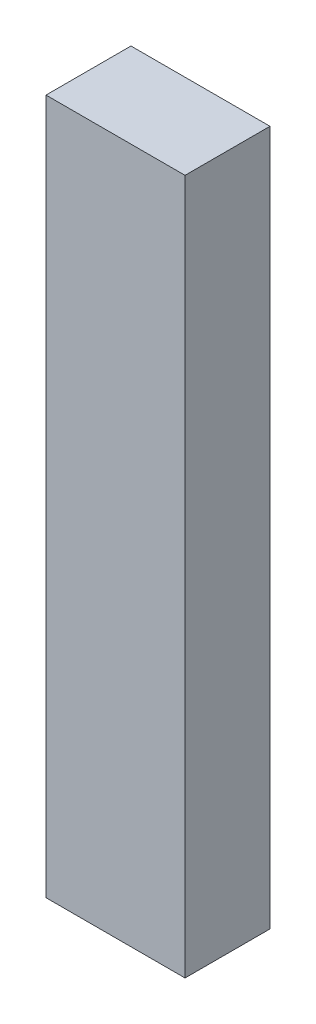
ISO-10303-21;
HEADER;
FILE_DESCRIPTION(('STEP AP214'),'2;1');
FILE_NAME('part.step','',(''),(''),'','','');
FILE_SCHEMA(('AUTOMOTIVE_DESIGN { 1 0 10303 214 1 1 1 1 }'));
ENDSEC;
DATA;
#1=APPLICATION_CONTEXT('core data for automotive mechanical design processes');
#2=APPLICATION_PROTOCOL_DEFINITION('international standard','automotive_design',2000,#1);
#3=PRODUCT_CONTEXT('',#1,'mechanical');
#4=PRODUCT('Part','Part','',(#3));
#5=PRODUCT_RELATED_PRODUCT_CATEGORY('part','',(#4));
#6=PRODUCT_DEFINITION_FORMATION('','',#4);
#7=PRODUCT_DEFINITION_CONTEXT('part definition',#1,'design');
#8=PRODUCT_DEFINITION('design','',#6,#7);
#9=PRODUCT_DEFINITION_SHAPE('','',#8);
#10=(LENGTH_UNIT() NAMED_UNIT(*) SI_UNIT(.MILLI.,.METRE.));
#11=(NAMED_UNIT(*) PLANE_ANGLE_UNIT() SI_UNIT($,.RADIAN.));
#12=(NAMED_UNIT(*) SI_UNIT($,.STERADIAN.) SOLID_ANGLE_UNIT());
#13=UNCERTAINTY_MEASURE_WITH_UNIT(LENGTH_MEASURE(1.E-05),#10,'distance_accuracy_value','');
#14=(GEOMETRIC_REPRESENTATION_CONTEXT(3) GLOBAL_UNCERTAINTY_ASSIGNED_CONTEXT((#13)) GLOBAL_UNIT_ASSIGNED_CONTEXT((#10,
#11,#12)) REPRESENTATION_CONTEXT('',''));
#15=CARTESIAN_POINT('',(0.,0.,0.));
#16=DIRECTION('',(0.,0.,1.));
#17=DIRECTION('',(1.,0.,0.));
#18=AXIS2_PLACEMENT_3D('',#15,#16,#17);
#19=CARTESIAN_POINT('',(9.,90.,-5.5));
#20=DIRECTION('',(-1.,0.,0.));
#21=DIRECTION('',(0.,0.,1.));
#22=AXIS2_PLACEMENT_3D('',#19,#20,#21);
#23=PLANE('',#22);
#24=DIRECTION('',(0.,0.,-1.));
#25=VECTOR('',#24,1.);
#26=CARTESIAN_POINT('',(9.,0.,-5.5));
#27=LINE('',#26,#25);
#28=CARTESIAN_POINT('',(9.,0.,5.5));
#29=VERTEX_POINT('',#28);
#30=CARTESIAN_POINT('',(9.,0.,-5.5));
#31=VERTEX_POINT('',#30);
#32=EDGE_CURVE('E102',#29,#31,#27,.T.);
#33=ORIENTED_EDGE('',*,*,#32,.T.);
#34=DIRECTION('',(0.,-1.,0.));
#35=VECTOR('',#34,1.);
#36=CARTESIAN_POINT('',(9.,90.,-5.5));
#37=LINE('',#36,#35);
#38=CARTESIAN_POINT('',(9.,90.,-5.5));
#39=VERTEX_POINT('',#38);
#40=EDGE_CURVE('E11',#39,#31,#37,.T.);
#41=ORIENTED_EDGE('',*,*,#40,.F.);
#42=DIRECTION('',(0.,0.,-1.));
#43=VECTOR('',#42,1.);
#44=CARTESIAN_POINT('',(9.,90.,-5.5));
#45=LINE('',#44,#43);
#46=CARTESIAN_POINT('',(9.,90.,5.5));
#47=VERTEX_POINT('',#46);
#48=EDGE_CURVE('E90',#47,#39,#45,.T.);
#49=ORIENTED_EDGE('',*,*,#48,.F.);
#50=DIRECTION('',(0.,-1.,0.));
#51=VECTOR('',#50,1.);
#52=CARTESIAN_POINT('',(9.,90.,5.5));
#53=LINE('',#52,#51);
#54=EDGE_CURVE('E98',#47,#29,#53,.T.);
#55=ORIENTED_EDGE('',*,*,#54,.T.);
#56=EDGE_LOOP('',(#33,#41,#49,#55));
#57=FACE_BOUND('',#56,.T.);
#58=ADVANCED_FACE('F39',(#57),#23,.F.);
#59=CARTESIAN_POINT('',(-9.,90.,-5.5));
#60=DIRECTION('',(0.,0.,1.));
#61=DIRECTION('',(1.,0.,0.));
#62=AXIS2_PLACEMENT_3D('',#59,#60,#61);
#63=PLANE('',#62);
#64=DIRECTION('',(-1.,0.,0.));
#65=VECTOR('',#64,1.);
#66=CARTESIAN_POINT('',(-9.,0.,-5.5));
#67=LINE('',#66,#65);
#68=CARTESIAN_POINT('',(-9.,0.,-5.5));
#69=VERTEX_POINT('',#68);
#70=EDGE_CURVE('E94',#31,#69,#67,.T.);
#71=ORIENTED_EDGE('',*,*,#70,.T.);
#72=DIRECTION('',(0.,-1.,0.));
#73=VECTOR('',#72,1.);
#74=CARTESIAN_POINT('',(-9.,90.,-5.5));
#75=LINE('',#74,#73);
#76=CARTESIAN_POINT('',(-9.,90.,-5.5));
#77=VERTEX_POINT('',#76);
#78=EDGE_CURVE('E47',#77,#69,#75,.T.);
#79=ORIENTED_EDGE('',*,*,#78,.F.);
#80=DIRECTION('',(-1.,0.,0.));
#81=VECTOR('',#80,1.);
#82=CARTESIAN_POINT('',(-9.,90.,-5.5));
#83=LINE('',#82,#81);
#84=EDGE_CURVE('E85',#39,#77,#83,.T.);
#85=ORIENTED_EDGE('',*,*,#84,.F.);
#86=ORIENTED_EDGE('',*,*,#40,.T.);
#87=EDGE_LOOP('',(#71,#79,#85,#86));
#88=FACE_BOUND('',#87,.T.);
#89=ADVANCED_FACE('F93',(#88),#63,.F.);
#90=CARTESIAN_POINT('',(-9.,90.,-5.5));
#91=DIRECTION('',(1.,0.,0.));
#92=DIRECTION('',(0.,0.,-1.));
#93=AXIS2_PLACEMENT_3D('',#90,#91,#92);
#94=PLANE('',#93);
#95=DIRECTION('',(0.,0.,1.));
#96=VECTOR('',#95,1.);
#97=CARTESIAN_POINT('',(-9.,0.,-5.5));
#98=LINE('',#97,#96);
#99=CARTESIAN_POINT('',(-9.,0.,5.5));
#100=VERTEX_POINT('',#99);
#101=EDGE_CURVE('E72',#69,#100,#98,.T.);
#102=ORIENTED_EDGE('',*,*,#101,.T.);
#103=DIRECTION('',(0.,-1.,0.));
#104=VECTOR('',#103,1.);
#105=CARTESIAN_POINT('',(-9.,90.,5.5));
#106=LINE('',#105,#104);
#107=CARTESIAN_POINT('',(-9.,90.,5.5));
#108=VERTEX_POINT('',#107);
#109=EDGE_CURVE('E95',#108,#100,#106,.T.);
#110=ORIENTED_EDGE('',*,*,#109,.F.);
#111=DIRECTION('',(0.,0.,1.));
#112=VECTOR('',#111,1.);
#113=CARTESIAN_POINT('',(-9.,90.,-5.5));
#114=LINE('',#113,#112);
#115=EDGE_CURVE('E88',#77,#108,#114,.T.);
#116=ORIENTED_EDGE('',*,*,#115,.F.);
#117=ORIENTED_EDGE('',*,*,#78,.T.);
#118=EDGE_LOOP('',(#102,#110,#116,#117));
#119=FACE_BOUND('',#118,.T.);
#120=ADVANCED_FACE('F96',(#119),#94,.F.);
#121=CARTESIAN_POINT('',(-9.,90.,5.5));
#122=DIRECTION('',(0.,0.,-1.));
#123=DIRECTION('',(-1.,0.,0.));
#124=AXIS2_PLACEMENT_3D('',#121,#122,#123);
#125=PLANE('',#124);
#126=DIRECTION('',(1.,0.,0.));
#127=VECTOR('',#126,1.);
#128=CARTESIAN_POINT('',(-9.,0.,5.5));
#129=LINE('',#128,#127);
#130=EDGE_CURVE('E78',#100,#29,#129,.T.);
#131=ORIENTED_EDGE('',*,*,#130,.T.);
#132=ORIENTED_EDGE('',*,*,#54,.F.);
#133=DIRECTION('',(1.,0.,0.));
#134=VECTOR('',#133,1.);
#135=CARTESIAN_POINT('',(-9.,90.,5.5));
#136=LINE('',#135,#134);
#137=EDGE_CURVE('E55',#108,#47,#136,.T.);
#138=ORIENTED_EDGE('',*,*,#137,.F.);
#139=ORIENTED_EDGE('',*,*,#109,.T.);
#140=EDGE_LOOP('',(#131,#132,#138,#139));
#141=FACE_BOUND('',#140,.T.);
#142=ADVANCED_FACE('F109',(#141),#125,.F.);
#143=CARTESIAN_POINT('',(0.,90.,0.));
#144=DIRECTION('',(0.,1.,0.));
#145=DIRECTION('',(0.,0.,1.));
#146=AXIS2_PLACEMENT_3D('',#143,#144,#145);
#147=PLANE('',#146);
#148=ORIENTED_EDGE('',*,*,#48,.T.);
#149=ORIENTED_EDGE('',*,*,#84,.T.);
#150=ORIENTED_EDGE('',*,*,#115,.T.);
#151=ORIENTED_EDGE('',*,*,#137,.T.);
#152=EDGE_LOOP('',(#148,#149,#150,#151));
#153=FACE_BOUND('',#152,.T.);
#154=ADVANCED_FACE('F86',(#153),#147,.T.);
#155=CARTESIAN_POINT('',(0.,0.,0.));
#156=DIRECTION('',(0.,1.,0.));
#157=DIRECTION('',(0.,0.,1.));
#158=AXIS2_PLACEMENT_3D('',#155,#156,#157);
#159=PLANE('',#158);
#160=ORIENTED_EDGE('',*,*,#32,.F.);
#161=ORIENTED_EDGE('',*,*,#130,.F.);
#162=ORIENTED_EDGE('',*,*,#101,.F.);
#163=ORIENTED_EDGE('',*,*,#70,.F.);
#164=EDGE_LOOP('',(#160,#161,#162,#163));
#165=FACE_BOUND('',#164,.T.);
#166=ADVANCED_FACE('F112',(#165),#159,.F.);
#167=CLOSED_SHELL('',(#58,#89,#120,#142,#154,#166));
#168=MANIFOLD_SOLID_BREP('B2',#167);
#169=ADVANCED_BREP_SHAPE_REPRESENTATION('',(#18,#168),#14);
#170=SHAPE_DEFINITION_REPRESENTATION(#9,#169);
ENDSEC;
END-ISO-10303-21;
